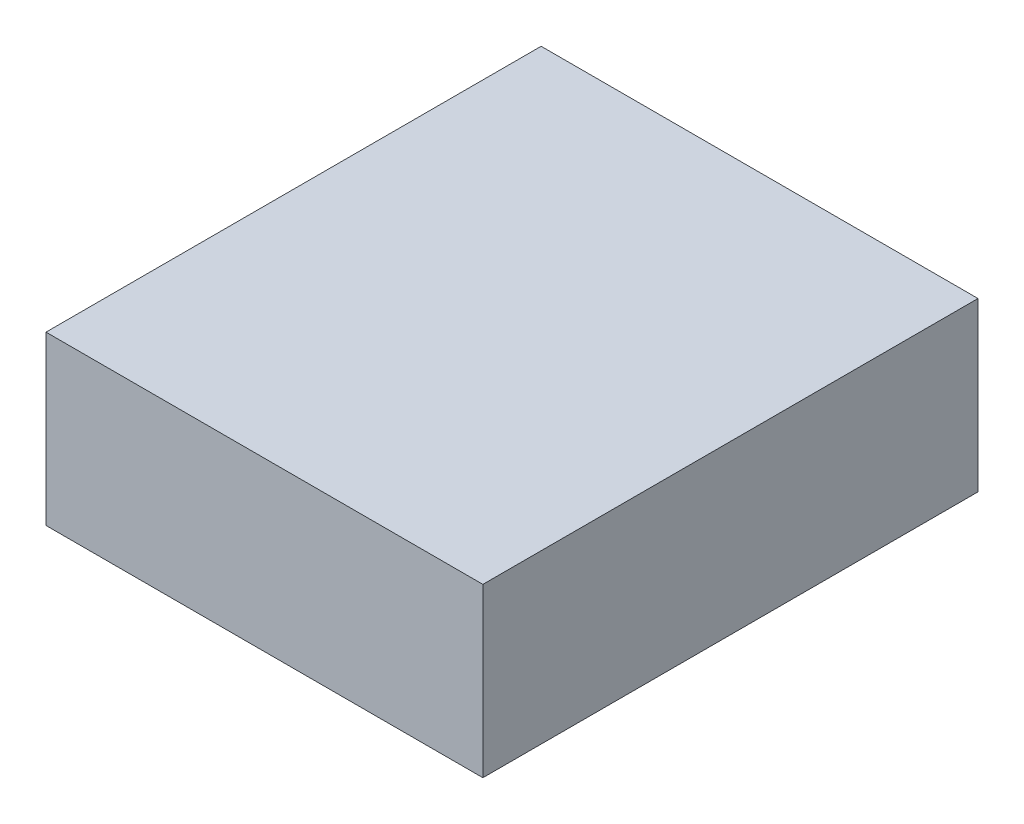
from build123d import *

# Parameters (mm, degrees)
SKETCH_1_W      = 30
SKETCH_1_H      = 11.5
EXTRUDE_1_DEPTH = 34


with BuildPart() as part:
    # Sketch 1 → Extrude 1 (new body)
    with BuildSketch(Plane.XY):
        Rectangle(SKETCH_1_W, SKETCH_1_H)
    extrude(amount=EXTRUDE_1_DEPTH)


solid = part.part
